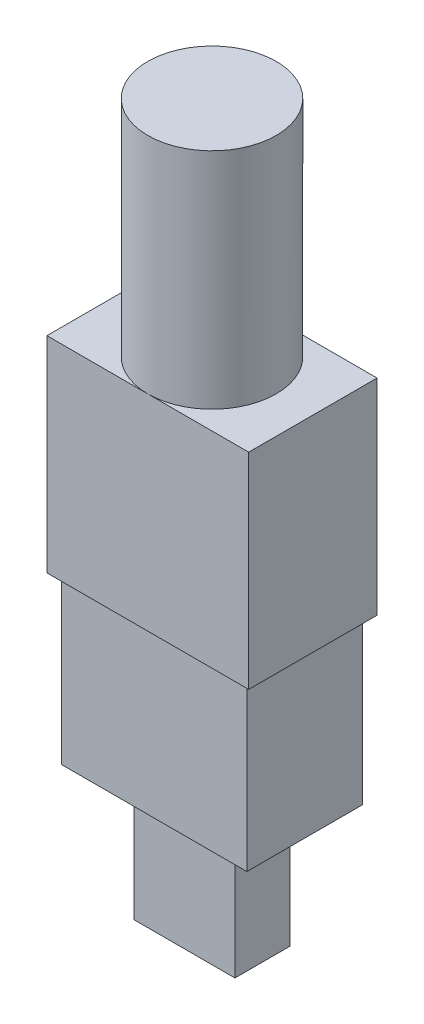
from build123d import *

# Parameters (mm, degrees)
SKETCH1_W           = 5.5
SKETCH1_H           = 3
BOSS_EXTRUDE1_DEPTH = 7
SKETCH2_W           = 10.1
SKETCH2_H           = 6.3
BOSS_EXTRUDE2_DEPTH = 9
SKETCH3_W           = 11
SKETCH3_H           = 7
BOSS_EXTRUDE3_DEPTH = 11.2
SKETCH4_R           = 3.5
BOSS_EXTRUDE4_DEPTH = 12.2


with BuildPart() as part:
    # Sketch1 → Boss-Extrude1 (new body)
    with BuildSketch(Plane(origin=(0, 0, 0), x_dir=(1, 0, 0), z_dir=(0, 1, 0))):
        with Locations((2.75, 1.5)):
            Rectangle(SKETCH1_W, SKETCH1_H)
    extrude(amount=BOSS_EXTRUDE1_DEPTH)

    # Sketch2 → Boss-Extrude2 (add)
    with BuildSketch(Plane(origin=(0, 7, 0), x_dir=(1, 0, 0), z_dir=(0, 1, 0))):
        with Locations((2.75, 1.5)):
            Rectangle(SKETCH2_W, SKETCH2_H)
    extrude(amount=BOSS_EXTRUDE2_DEPTH)

    # Sketch3 → Boss-Extrude3 (add)
    with BuildSketch(Plane(origin=(0, 16, 0), x_dir=(1, 0, 0), z_dir=(0, 1, 0))):
        with Locations((2.75, 1.5)):
            Rectangle(SKETCH3_W, SKETCH3_H)
    extrude(amount=BOSS_EXTRUDE3_DEPTH)

    # Sketch4 → Boss-Extrude4 (add)
    with BuildSketch(Plane(origin=(0, 27.2, 0), x_dir=(1, 0, 0), z_dir=(0, 1, 0))):
        with Locations(Location((2.75, 1.5, 0), (0, 0, 270))):
            Circle(SKETCH4_R)
    extrude(amount=BOSS_EXTRUDE4_DEPTH)


solid = part.part
